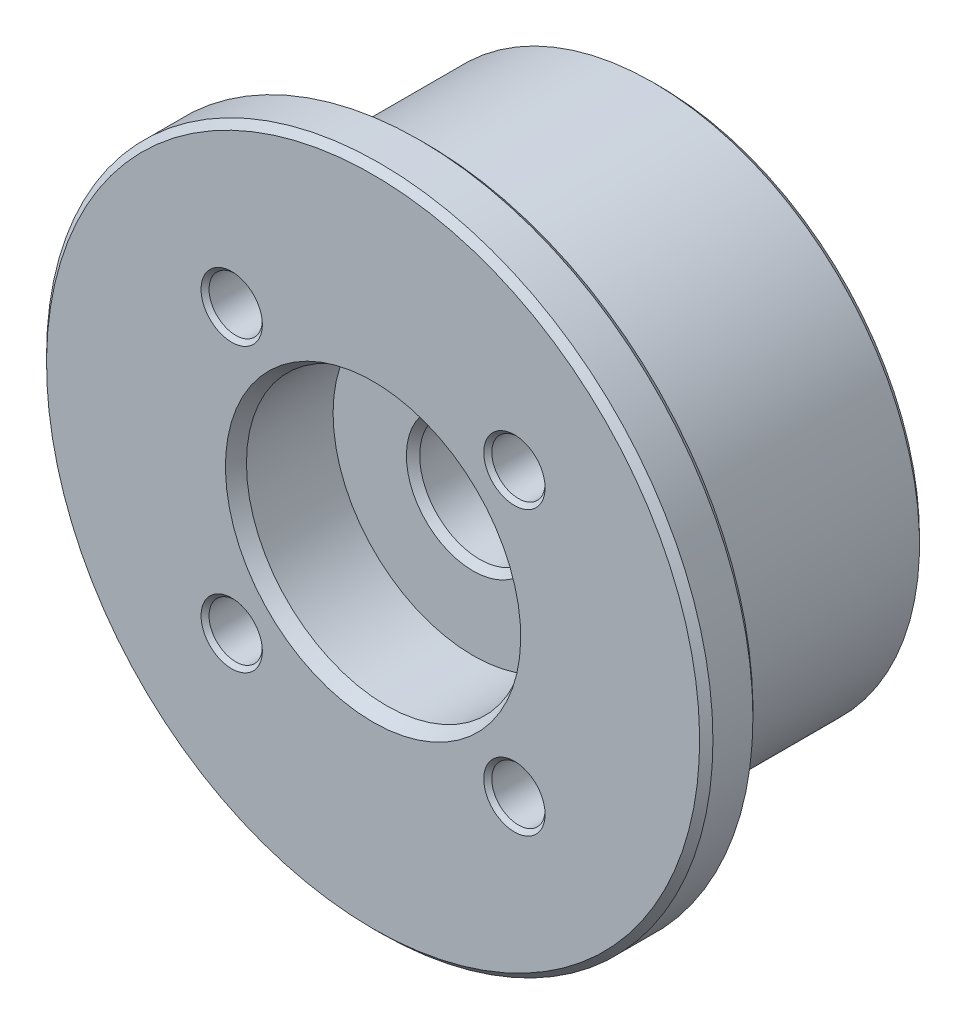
ISO-10303-21;
HEADER;
FILE_DESCRIPTION(('STEP AP214'),'2;1');
FILE_NAME('part.step','',(''),(''),'','','');
FILE_SCHEMA(('AUTOMOTIVE_DESIGN { 1 0 10303 214 1 1 1 1 }'));
ENDSEC;
DATA;
#1=APPLICATION_CONTEXT('core data for automotive mechanical design processes');
#2=APPLICATION_PROTOCOL_DEFINITION('international standard','automotive_design',2000,#1);
#3=PRODUCT_CONTEXT('',#1,'mechanical');
#4=PRODUCT('Part','Part','',(#3));
#5=PRODUCT_RELATED_PRODUCT_CATEGORY('part','',(#4));
#6=PRODUCT_DEFINITION_FORMATION('','',#4);
#7=PRODUCT_DEFINITION_CONTEXT('part definition',#1,'design');
#8=PRODUCT_DEFINITION('design','',#6,#7);
#9=PRODUCT_DEFINITION_SHAPE('','',#8);
#10=(LENGTH_UNIT() NAMED_UNIT(*) SI_UNIT(.MILLI.,.METRE.));
#11=(NAMED_UNIT(*) PLANE_ANGLE_UNIT() SI_UNIT($,.RADIAN.));
#12=(NAMED_UNIT(*) SI_UNIT($,.STERADIAN.) SOLID_ANGLE_UNIT());
#13=UNCERTAINTY_MEASURE_WITH_UNIT(LENGTH_MEASURE(1.E-05),#10,'distance_accuracy_value','');
#14=(GEOMETRIC_REPRESENTATION_CONTEXT(3) GLOBAL_UNCERTAINTY_ASSIGNED_CONTEXT((#13)) GLOBAL_UNIT_ASSIGNED_CONTEXT((#10,
#11,#12)) REPRESENTATION_CONTEXT('',''));
#15=CARTESIAN_POINT('',(0.,0.,0.));
#16=DIRECTION('',(0.,0.,1.));
#17=DIRECTION('',(1.,0.,0.));
#18=AXIS2_PLACEMENT_3D('',#15,#16,#17);
#19=CARTESIAN_POINT('',(0.,0.,0.));
#20=DIRECTION('',(0.,0.,-1.));
#21=DIRECTION('',(0.,1.,0.));
#22=AXIS2_PLACEMENT_3D('',#19,#20,#21);
#23=CYLINDRICAL_SURFACE('',#22,40.);
#24=CARTESIAN_POINT('',(0.,0.,1.00000000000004));
#25=DIRECTION('',(0.,0.,1.));
#26=DIRECTION('',(0.,-1.,0.));
#27=AXIS2_PLACEMENT_3D('',#24,#25,#26);
#28=CIRCLE('',#27,40.);
#29=CARTESIAN_POINT('',(0.,-40.,1.00000000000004));
#30=VERTEX_POINT('',#29);
#31=EDGE_CURVE('E101',#30,#30,#28,.T.);
#32=ORIENTED_EDGE('',*,*,#31,.T.);
#33=EDGE_LOOP('',(#32));
#34=FACE_BOUND('',#33,.T.);
#35=CARTESIAN_POINT('',(0.,0.,32.));
#36=DIRECTION('',(0.,0.,-1.));
#37=DIRECTION('',(0.,1.,0.));
#38=AXIS2_PLACEMENT_3D('',#35,#36,#37);
#39=CIRCLE('',#38,40.);
#40=CARTESIAN_POINT('',(0.,40.,32.));
#41=VERTEX_POINT('',#40);
#42=EDGE_CURVE('E32',#41,#41,#39,.T.);
#43=ORIENTED_EDGE('',*,*,#42,.T.);
#44=EDGE_LOOP('',(#43));
#45=FACE_BOUND('',#44,.T.);
#46=ADVANCED_FACE('F12',(#34,#45),#23,.T.);
#47=CARTESIAN_POINT('',(50.,0.,35.));
#48=DIRECTION('',(0.,0.,1.));
#49=DIRECTION('',(0.,-1.,0.));
#50=AXIS2_PLACEMENT_3D('',#47,#48,#49);
#51=PLANE('',#50);
#52=CARTESIAN_POINT('',(0.,0.,35.));
#53=DIRECTION('',(0.,0.,1.));
#54=DIRECTION('',(0.,-1.,0.));
#55=AXIS2_PLACEMENT_3D('',#52,#53,#54);
#56=CIRCLE('',#55,49.);
#57=CARTESIAN_POINT('',(0.,-49.,35.));
#58=VERTEX_POINT('',#57);
#59=EDGE_CURVE('E104',#58,#58,#56,.F.);
#60=ORIENTED_EDGE('',*,*,#59,.T.);
#61=EDGE_LOOP('',(#60));
#62=FACE_BOUND('',#61,.T.);
#63=CARTESIAN_POINT('',(0.,0.,35.));
#64=DIRECTION('',(0.,0.,-1.));
#65=DIRECTION('',(0.,1.,0.));
#66=AXIS2_PLACEMENT_3D('',#63,#64,#65);
#67=CIRCLE('',#66,42.);
#68=CARTESIAN_POINT('',(0.,42.,35.));
#69=VERTEX_POINT('',#68);
#70=EDGE_CURVE('E68',#69,#69,#67,.T.);
#71=ORIENTED_EDGE('',*,*,#70,.F.);
#72=EDGE_LOOP('',(#71));
#73=FACE_BOUND('',#72,.T.);
#74=ADVANCED_FACE('F151',(#62,#73),#51,.F.);
#75=CARTESIAN_POINT('',(0.,0.,43.));
#76=DIRECTION('',(0.,0.,-1.));
#77=DIRECTION('',(0.,1.,0.));
#78=AXIS2_PLACEMENT_3D('',#75,#76,#77);
#79=CYLINDRICAL_SURFACE('',#78,50.);
#80=CARTESIAN_POINT('',(0.,0.,36.));
#81=DIRECTION('',(0.,0.,1.));
#82=DIRECTION('',(0.,-1.,0.));
#83=AXIS2_PLACEMENT_3D('',#80,#81,#82);
#84=CIRCLE('',#83,50.);
#85=CARTESIAN_POINT('',(0.,-50.,36.));
#86=VERTEX_POINT('',#85);
#87=EDGE_CURVE('E107',#86,#86,#84,.T.);
#88=ORIENTED_EDGE('',*,*,#87,.T.);
#89=EDGE_LOOP('',(#88));
#90=FACE_BOUND('',#89,.T.);
#91=CARTESIAN_POINT('',(0.,0.,42.));
#92=DIRECTION('',(0.,0.,1.));
#93=DIRECTION('',(0.,-1.,0.));
#94=AXIS2_PLACEMENT_3D('',#91,#92,#93);
#95=CIRCLE('',#94,50.);
#96=CARTESIAN_POINT('',(0.,-50.,42.));
#97=VERTEX_POINT('',#96);
#98=EDGE_CURVE('E86',#97,#97,#95,.F.);
#99=ORIENTED_EDGE('',*,*,#98,.T.);
#100=EDGE_LOOP('',(#99));
#101=FACE_BOUND('',#100,.T.);
#102=ADVANCED_FACE('F158',(#90,#101),#79,.T.);
#103=CARTESIAN_POINT('',(0.,0.,43.));
#104=DIRECTION('',(0.,0.,1.));
#105=DIRECTION('',(0.,-1.,0.));
#106=AXIS2_PLACEMENT_3D('',#103,#104,#105);
#107=PLANE('',#106);
#108=CARTESIAN_POINT('',(0.,0.,43.));
#109=DIRECTION('',(0.,0.,1.));
#110=DIRECTION('',(0.,-1.,0.));
#111=AXIS2_PLACEMENT_3D('',#108,#109,#110);
#112=CIRCLE('',#111,22.1547005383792);
#113=CARTESIAN_POINT('',(0.,-22.1547005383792,43.));
#114=VERTEX_POINT('',#113);
#115=EDGE_CURVE('E95',#114,#114,#112,.F.);
#116=ORIENTED_EDGE('',*,*,#115,.T.);
#117=EDGE_LOOP('',(#116));
#118=FACE_BOUND('',#117,.T.);
#119=CARTESIAN_POINT('',(0.,0.,43.));
#120=DIRECTION('',(0.,0.,1.));
#121=DIRECTION('',(0.,-1.,0.));
#122=AXIS2_PLACEMENT_3D('',#119,#120,#121);
#123=CIRCLE('',#122,49.);
#124=CARTESIAN_POINT('',(0.,-49.,43.));
#125=VERTEX_POINT('',#124);
#126=EDGE_CURVE('E89',#125,#125,#123,.T.);
#127=ORIENTED_EDGE('',*,*,#126,.T.);
#128=EDGE_LOOP('',(#127));
#129=FACE_BOUND('',#128,.T.);
#130=CARTESIAN_POINT('',(-21.2132034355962,21.2132034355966,43.));
#131=DIRECTION('',(0.,0.,1.));
#132=DIRECTION('',(0.,-1.,0.));
#133=AXIS2_PLACEMENT_3D('',#130,#131,#132);
#134=CIRCLE('',#133,4.6);
#135=CARTESIAN_POINT('',(-21.2132034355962,16.6132034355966,43.));
#136=VERTEX_POINT('',#135);
#137=EDGE_CURVE('E71',#136,#136,#134,.T.);
#138=ORIENTED_EDGE('',*,*,#137,.F.);
#139=EDGE_LOOP('',(#138));
#140=FACE_BOUND('',#139,.T.);
#141=CARTESIAN_POINT('',(-21.2132034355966,-21.2132034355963,43.));
#142=DIRECTION('',(0.,0.,1.));
#143=DIRECTION('',(0.,-1.,0.));
#144=AXIS2_PLACEMENT_3D('',#141,#142,#143);
#145=CIRCLE('',#144,4.6);
#146=CARTESIAN_POINT('',(-21.2132034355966,-25.8132034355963,43.));
#147=VERTEX_POINT('',#146);
#148=EDGE_CURVE('E74',#147,#147,#145,.T.);
#149=ORIENTED_EDGE('',*,*,#148,.F.);
#150=EDGE_LOOP('',(#149));
#151=FACE_BOUND('',#150,.T.);
#152=CARTESIAN_POINT('',(21.2132034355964,-21.2132034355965,43.));
#153=DIRECTION('',(0.,0.,1.));
#154=DIRECTION('',(0.,-1.,0.));
#155=AXIS2_PLACEMENT_3D('',#152,#153,#154);
#156=CIRCLE('',#155,4.6);
#157=CARTESIAN_POINT('',(21.2132034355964,-25.8132034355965,43.));
#158=VERTEX_POINT('',#157);
#159=EDGE_CURVE('E77',#158,#158,#156,.T.);
#160=ORIENTED_EDGE('',*,*,#159,.F.);
#161=EDGE_LOOP('',(#160));
#162=FACE_BOUND('',#161,.T.);
#163=CARTESIAN_POINT('',(21.2132034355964,21.2132034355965,43.));
#164=DIRECTION('',(0.,0.,1.));
#165=DIRECTION('',(0.,-1.,0.));
#166=AXIS2_PLACEMENT_3D('',#163,#164,#165);
#167=CIRCLE('',#166,4.6);
#168=CARTESIAN_POINT('',(21.2132034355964,16.6132034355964,43.));
#169=VERTEX_POINT('',#168);
#170=EDGE_CURVE('E80',#169,#169,#167,.T.);
#171=ORIENTED_EDGE('',*,*,#170,.F.);
#172=EDGE_LOOP('',(#171));
#173=FACE_BOUND('',#172,.T.);
#174=ADVANCED_FACE('F127',(#118,#129,#140,#151,#162,#173),#107,.T.);
#175=CARTESIAN_POINT('',(0.,0.,0.));
#176=DIRECTION('',(0.,0.,1.));
#177=DIRECTION('',(0.,-1.,0.));
#178=AXIS2_PLACEMENT_3D('',#175,#176,#177);
#179=PLANE('',#178);
#180=CARTESIAN_POINT('',(0.,0.,0.));
#181=DIRECTION('',(0.,0.,1.));
#182=DIRECTION('',(0.,-1.,0.));
#183=AXIS2_PLACEMENT_3D('',#180,#181,#182);
#184=CIRCLE('',#183,10.1547005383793);
#185=CARTESIAN_POINT('',(0.,-10.1547005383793,0.));
#186=VERTEX_POINT('',#185);
#187=EDGE_CURVE('E110',#186,#186,#184,.T.);
#188=ORIENTED_EDGE('',*,*,#187,.T.);
#189=EDGE_LOOP('',(#188));
#190=FACE_BOUND('',#189,.T.);
#191=CARTESIAN_POINT('',(0.,0.,0.));
#192=DIRECTION('',(0.,0.,1.));
#193=DIRECTION('',(0.,-1.,0.));
#194=AXIS2_PLACEMENT_3D('',#191,#192,#193);
#195=CIRCLE('',#194,39.);
#196=CARTESIAN_POINT('',(0.,-39.,0.));
#197=VERTEX_POINT('',#196);
#198=EDGE_CURVE('E98',#197,#197,#195,.F.);
#199=ORIENTED_EDGE('',*,*,#198,.T.);
#200=EDGE_LOOP('',(#199));
#201=FACE_BOUND('',#200,.T.);
#202=ADVANCED_FACE('F123',(#190,#201),#179,.F.);
#203=CARTESIAN_POINT('',(0.,0.,28.));
#204=DIRECTION('',(0.,0.,1.));
#205=DIRECTION('',(0.,-1.,0.));
#206=AXIS2_PLACEMENT_3D('',#203,#204,#205);
#207=CYLINDRICAL_SURFACE('',#206,21.);
#208=CARTESIAN_POINT('',(0.,0.,41.));
#209=DIRECTION('',(0.,0.,1.));
#210=DIRECTION('',(0.,-1.,0.));
#211=AXIS2_PLACEMENT_3D('',#208,#209,#210);
#212=CIRCLE('',#211,21.);
#213=CARTESIAN_POINT('',(0.,-21.,41.));
#214=VERTEX_POINT('',#213);
#215=EDGE_CURVE('E92',#214,#214,#212,.T.);
#216=ORIENTED_EDGE('',*,*,#215,.T.);
#217=EDGE_LOOP('',(#216));
#218=FACE_BOUND('',#217,.T.);
#219=CARTESIAN_POINT('',(0.,0.,28.));
#220=DIRECTION('',(0.,0.,1.));
#221=DIRECTION('',(0.,-1.,0.));
#222=AXIS2_PLACEMENT_3D('',#219,#220,#221);
#223=CIRCLE('',#222,21.);
#224=CARTESIAN_POINT('',(0.,-21.,28.));
#225=VERTEX_POINT('',#224);
#226=EDGE_CURVE('E83',#225,#225,#223,.T.);
#227=ORIENTED_EDGE('',*,*,#226,.F.);
#228=EDGE_LOOP('',(#227));
#229=FACE_BOUND('',#228,.T.);
#230=ADVANCED_FACE('F126',(#218,#229),#207,.F.);
#231=CARTESIAN_POINT('',(0.,0.,28.));
#232=DIRECTION('',(0.,0.,1.));
#233=DIRECTION('',(0.,-1.,0.));
#234=AXIS2_PLACEMENT_3D('',#231,#232,#233);
#235=PLANE('',#234);
#236=CARTESIAN_POINT('',(0.,0.,28.));
#237=DIRECTION('',(0.,0.,1.));
#238=DIRECTION('',(0.,-1.,0.));
#239=AXIS2_PLACEMENT_3D('',#236,#237,#238);
#240=CIRCLE('',#239,10.);
#241=CARTESIAN_POINT('',(0.,-10.,28.));
#242=VERTEX_POINT('',#241);
#243=EDGE_CURVE('E8',#242,#242,#240,.F.);
#244=ORIENTED_EDGE('',*,*,#243,.T.);
#245=EDGE_LOOP('',(#244));
#246=FACE_BOUND('',#245,.T.);
#247=ORIENTED_EDGE('',*,*,#226,.T.);
#248=EDGE_LOOP('',(#247));
#249=FACE_BOUND('',#248,.T.);
#250=ADVANCED_FACE('F181',(#246,#249),#235,.T.);
#251=CARTESIAN_POINT('',(0.,0.,43.));
#252=DIRECTION('',(0.,0.,1.));
#253=DIRECTION('',(0.,-1.,0.));
#254=AXIS2_PLACEMENT_3D('',#251,#252,#253);
#255=CYLINDRICAL_SURFACE('',#254,9.);
#256=CARTESIAN_POINT('',(0.,0.,27.));
#257=DIRECTION('',(0.,0.,1.));
#258=DIRECTION('',(0.,-1.,0.));
#259=AXIS2_PLACEMENT_3D('',#256,#257,#258);
#260=CIRCLE('',#259,9.);
#261=CARTESIAN_POINT('',(0.,-9.,27.));
#262=VERTEX_POINT('',#261);
#263=EDGE_CURVE('E20',#262,#262,#260,.T.);
#264=ORIENTED_EDGE('',*,*,#263,.T.);
#265=EDGE_LOOP('',(#264));
#266=FACE_BOUND('',#265,.T.);
#267=CARTESIAN_POINT('',(0.,0.,2.00000000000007));
#268=DIRECTION('',(0.,0.,1.));
#269=DIRECTION('',(0.,-1.,0.));
#270=AXIS2_PLACEMENT_3D('',#267,#268,#269);
#271=CIRCLE('',#270,9.);
#272=CARTESIAN_POINT('',(0.,-9.,2.00000000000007));
#273=VERTEX_POINT('',#272);
#274=EDGE_CURVE('E25',#273,#273,#271,.F.);
#275=ORIENTED_EDGE('',*,*,#274,.T.);
#276=EDGE_LOOP('',(#275));
#277=FACE_BOUND('',#276,.T.);
#278=ADVANCED_FACE('F115',(#266,#277),#255,.F.);
#279=CARTESIAN_POINT('',(21.2132034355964,21.2132034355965,43.));
#280=DIRECTION('',(0.,0.,1.));
#281=DIRECTION('',(0.,-1.,0.));
#282=AXIS2_PLACEMENT_3D('',#279,#280,#281);
#283=CONICAL_SURFACE('',#282,4.6,0.78539816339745);
#284=CARTESIAN_POINT('',(21.2132034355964,21.2132034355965,42.4));
#285=DIRECTION('',(0.,0.,1.));
#286=DIRECTION('',(0.,-1.,0.));
#287=AXIS2_PLACEMENT_3D('',#284,#285,#286);
#288=CIRCLE('',#287,4.);
#289=CARTESIAN_POINT('',(21.2132034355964,17.2132034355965,42.4));
#290=VERTEX_POINT('',#289);
#291=EDGE_CURVE('E37',#290,#290,#288,.F.);
#292=ORIENTED_EDGE('',*,*,#291,.T.);
#293=EDGE_LOOP('',(#292));
#294=FACE_BOUND('',#293,.T.);
#295=ORIENTED_EDGE('',*,*,#170,.T.);
#296=EDGE_LOOP('',(#295));
#297=FACE_BOUND('',#296,.T.);
#298=ADVANCED_FACE('F175',(#294,#297),#283,.F.);
#299=CARTESIAN_POINT('',(21.2132034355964,-21.2132034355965,43.));
#300=DIRECTION('',(0.,0.,1.));
#301=DIRECTION('',(0.,-1.,0.));
#302=AXIS2_PLACEMENT_3D('',#299,#300,#301);
#303=CONICAL_SURFACE('',#302,4.6,0.78539816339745);
#304=CARTESIAN_POINT('',(21.2132034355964,-21.2132034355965,42.4));
#305=DIRECTION('',(0.,0.,1.));
#306=DIRECTION('',(0.,-1.,0.));
#307=AXIS2_PLACEMENT_3D('',#304,#305,#306);
#308=CIRCLE('',#307,4.);
#309=CARTESIAN_POINT('',(21.2132034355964,-25.2132034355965,42.4));
#310=VERTEX_POINT('',#309);
#311=EDGE_CURVE('E16',#310,#310,#308,.F.);
#312=ORIENTED_EDGE('',*,*,#311,.T.);
#313=EDGE_LOOP('',(#312));
#314=FACE_BOUND('',#313,.T.);
#315=ORIENTED_EDGE('',*,*,#159,.T.);
#316=EDGE_LOOP('',(#315));
#317=FACE_BOUND('',#316,.T.);
#318=ADVANCED_FACE('F171',(#314,#317),#303,.F.);
#319=CARTESIAN_POINT('',(-21.2132034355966,-21.2132034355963,43.));
#320=DIRECTION('',(0.,0.,1.));
#321=DIRECTION('',(0.,-1.,0.));
#322=AXIS2_PLACEMENT_3D('',#319,#320,#321);
#323=CONICAL_SURFACE('',#322,4.6,0.78539816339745);
#324=CARTESIAN_POINT('',(-21.2132034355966,-21.2132034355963,42.4));
#325=DIRECTION('',(0.,0.,1.));
#326=DIRECTION('',(0.,-1.,0.));
#327=AXIS2_PLACEMENT_3D('',#324,#325,#326);
#328=CIRCLE('',#327,4.);
#329=CARTESIAN_POINT('',(-21.2132034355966,-25.2132034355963,42.4));
#330=VERTEX_POINT('',#329);
#331=EDGE_CURVE('E29',#330,#330,#328,.F.);
#332=ORIENTED_EDGE('',*,*,#331,.T.);
#333=EDGE_LOOP('',(#332));
#334=FACE_BOUND('',#333,.T.);
#335=ORIENTED_EDGE('',*,*,#148,.T.);
#336=EDGE_LOOP('',(#335));
#337=FACE_BOUND('',#336,.T.);
#338=ADVANCED_FACE('F167',(#334,#337),#323,.F.);
#339=CARTESIAN_POINT('',(-21.2132034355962,21.2132034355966,43.));
#340=DIRECTION('',(0.,0.,1.));
#341=DIRECTION('',(0.,-1.,0.));
#342=AXIS2_PLACEMENT_3D('',#339,#340,#341);
#343=CONICAL_SURFACE('',#342,4.6,0.78539816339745);
#344=CARTESIAN_POINT('',(-21.2132034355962,21.2132034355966,42.4));
#345=DIRECTION('',(0.,0.,1.));
#346=DIRECTION('',(0.,-1.,0.));
#347=AXIS2_PLACEMENT_3D('',#344,#345,#346);
#348=CIRCLE('',#347,4.);
#349=CARTESIAN_POINT('',(-21.2132034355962,17.2132034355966,42.4));
#350=VERTEX_POINT('',#349);
#351=EDGE_CURVE('E34',#350,#350,#348,.F.);
#352=ORIENTED_EDGE('',*,*,#351,.T.);
#353=EDGE_LOOP('',(#352));
#354=FACE_BOUND('',#353,.T.);
#355=ORIENTED_EDGE('',*,*,#137,.T.);
#356=EDGE_LOOP('',(#355));
#357=FACE_BOUND('',#356,.T.);
#358=ADVANCED_FACE('F164',(#354,#357),#343,.F.);
#359=CARTESIAN_POINT('',(0.,0.,43.));
#360=DIRECTION('',(0.,0.,-1.));
#361=DIRECTION('',(0.,1.,0.));
#362=AXIS2_PLACEMENT_3D('',#359,#360,#361);
#363=CONICAL_SURFACE('',#362,49.,0.785398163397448);
#364=ORIENTED_EDGE('',*,*,#98,.F.);
#365=EDGE_LOOP('',(#364));
#366=FACE_BOUND('',#365,.T.);
#367=ORIENTED_EDGE('',*,*,#126,.F.);
#368=EDGE_LOOP('',(#367));
#369=FACE_BOUND('',#368,.T.);
#370=ADVANCED_FACE('F146',(#366,#369),#363,.T.);
#371=CARTESIAN_POINT('',(0.,0.,41.));
#372=DIRECTION('',(0.,0.,1.));
#373=DIRECTION('',(0.,-1.,0.));
#374=AXIS2_PLACEMENT_3D('',#371,#372,#373);
#375=CONICAL_SURFACE('',#374,21.,0.523598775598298);
#376=ORIENTED_EDGE('',*,*,#115,.F.);
#377=EDGE_LOOP('',(#376));
#378=FACE_BOUND('',#377,.T.);
#379=ORIENTED_EDGE('',*,*,#215,.F.);
#380=EDGE_LOOP('',(#379));
#381=FACE_BOUND('',#380,.T.);
#382=ADVANCED_FACE('F134',(#378,#381),#375,.F.);
#383=CARTESIAN_POINT('',(0.,0.,0.));
#384=DIRECTION('',(0.,0.,1.));
#385=DIRECTION('',(0.,-1.,0.));
#386=AXIS2_PLACEMENT_3D('',#383,#384,#385);
#387=CONICAL_SURFACE('',#386,39.,0.785398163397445);
#388=ORIENTED_EDGE('',*,*,#31,.F.);
#389=EDGE_LOOP('',(#388));
#390=FACE_BOUND('',#389,.T.);
#391=ORIENTED_EDGE('',*,*,#198,.F.);
#392=EDGE_LOOP('',(#391));
#393=FACE_BOUND('',#392,.T.);
#394=ADVANCED_FACE('F131',(#390,#393),#387,.T.);
#395=CARTESIAN_POINT('',(0.,0.,35.));
#396=DIRECTION('',(0.,0.,1.));
#397=DIRECTION('',(0.,-1.,0.));
#398=AXIS2_PLACEMENT_3D('',#395,#396,#397);
#399=CONICAL_SURFACE('',#398,49.,0.785398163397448);
#400=ORIENTED_EDGE('',*,*,#87,.F.);
#401=EDGE_LOOP('',(#400));
#402=FACE_BOUND('',#401,.T.);
#403=ORIENTED_EDGE('',*,*,#59,.F.);
#404=EDGE_LOOP('',(#403));
#405=FACE_BOUND('',#404,.T.);
#406=ADVANCED_FACE('F133',(#402,#405),#399,.T.);
#407=CARTESIAN_POINT('',(0.,0.,35.5));
#408=DIRECTION('',(0.,0.,-1.));
#409=DIRECTION('',(0.,1.,0.));
#410=AXIS2_PLACEMENT_3D('',#407,#408,#409);
#411=CONICAL_SURFACE('',#410,41.5,0.785398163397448);
#412=ORIENTED_EDGE('',*,*,#70,.T.);
#413=EDGE_LOOP('',(#412));
#414=FACE_BOUND('',#413,.T.);
#415=CARTESIAN_POINT('',(0.,0.,35.5));
#416=DIRECTION('',(0.,0.,-1.));
#417=DIRECTION('',(0.,1.,0.));
#418=AXIS2_PLACEMENT_3D('',#415,#416,#417);
#419=CIRCLE('',#418,41.5);
#420=CARTESIAN_POINT('',(0.,41.5,35.5));
#421=VERTEX_POINT('',#420);
#422=EDGE_CURVE('E65',#421,#421,#419,.T.);
#423=ORIENTED_EDGE('',*,*,#422,.F.);
#424=EDGE_LOOP('',(#423));
#425=FACE_BOUND('',#424,.T.);
#426=ADVANCED_FACE('F143',(#414,#425),#411,.F.);
#427=CARTESIAN_POINT('',(-41.5,0.,35.5));
#428=DIRECTION('',(0.,0.,-1.));
#429=DIRECTION('',(0.,1.,0.));
#430=AXIS2_PLACEMENT_3D('',#427,#428,#429);
#431=PLANE('',#430);
#432=ORIENTED_EDGE('',*,*,#422,.T.);
#433=EDGE_LOOP('',(#432));
#434=FACE_BOUND('',#433,.T.);
#435=CARTESIAN_POINT('',(0.,0.,35.5));
#436=DIRECTION('',(0.,0.,-1.));
#437=DIRECTION('',(0.,1.,0.));
#438=AXIS2_PLACEMENT_3D('',#435,#436,#437);
#439=CIRCLE('',#438,39.9);
#440=CARTESIAN_POINT('',(0.,39.9,35.5));
#441=VERTEX_POINT('',#440);
#442=EDGE_CURVE('E62',#441,#441,#439,.T.);
#443=ORIENTED_EDGE('',*,*,#442,.F.);
#444=EDGE_LOOP('',(#443));
#445=FACE_BOUND('',#444,.T.);
#446=ADVANCED_FACE('F315',(#434,#445),#431,.T.);
#447=CARTESIAN_POINT('',(0.,0.,35.1));
#448=DIRECTION('',(0.,0.,-1.));
#449=DIRECTION('',(0.,1.,0.));
#450=AXIS2_PLACEMENT_3D('',#447,#448,#449);
#451=TOROIDAL_SURFACE('',#450,39.9,0.4);
#452=ORIENTED_EDGE('',*,*,#442,.T.);
#453=EDGE_LOOP('',(#452));
#454=FACE_BOUND('',#453,.T.);
#455=CARTESIAN_POINT('',(0.,0.,35.1));
#456=DIRECTION('',(0.,0.,-1.));
#457=DIRECTION('',(0.,1.,0.));
#458=AXIS2_PLACEMENT_3D('',#455,#456,#457);
#459=CIRCLE('',#458,39.5);
#460=CARTESIAN_POINT('',(0.,39.5,35.1));
#461=VERTEX_POINT('',#460);
#462=EDGE_CURVE('E59',#461,#461,#459,.T.);
#463=ORIENTED_EDGE('',*,*,#462,.F.);
#464=EDGE_LOOP('',(#463));
#465=FACE_BOUND('',#464,.T.);
#466=ADVANCED_FACE('F322',(#454,#465),#451,.F.);
#467=CARTESIAN_POINT('',(0.,0.,0.999999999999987));
#468=DIRECTION('',(0.,0.,-1.));
#469=DIRECTION('',(0.,1.,0.));
#470=AXIS2_PLACEMENT_3D('',#467,#468,#469);
#471=CYLINDRICAL_SURFACE('',#470,39.5);
#472=ORIENTED_EDGE('',*,*,#462,.T.);
#473=EDGE_LOOP('',(#472));
#474=FACE_BOUND('',#473,.T.);
#475=CARTESIAN_POINT('',(0.,0.,32.5));
#476=DIRECTION('',(0.,0.,-1.));
#477=DIRECTION('',(0.,1.,0.));
#478=AXIS2_PLACEMENT_3D('',#475,#476,#477);
#479=CIRCLE('',#478,39.5);
#480=CARTESIAN_POINT('',(0.,39.5,32.5));
#481=VERTEX_POINT('',#480);
#482=EDGE_CURVE('E56',#481,#481,#479,.T.);
#483=ORIENTED_EDGE('',*,*,#482,.F.);
#484=EDGE_LOOP('',(#483));
#485=FACE_BOUND('',#484,.T.);
#486=ADVANCED_FACE('F330',(#474,#485),#471,.T.);
#487=CARTESIAN_POINT('',(0.,0.,32.));
#488=DIRECTION('',(0.,0.,-1.));
#489=DIRECTION('',(0.,1.,0.));
#490=AXIS2_PLACEMENT_3D('',#487,#488,#489);
#491=CONICAL_SURFACE('',#490,40.,0.785398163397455);
#492=ORIENTED_EDGE('',*,*,#482,.T.);
#493=EDGE_LOOP('',(#492));
#494=FACE_BOUND('',#493,.T.);
#495=ORIENTED_EDGE('',*,*,#42,.F.);
#496=EDGE_LOOP('',(#495));
#497=FACE_BOUND('',#496,.T.);
#498=ADVANCED_FACE('F120',(#494,#497),#491,.T.);
#499=CARTESIAN_POINT('',(0.,0.,0.));
#500=DIRECTION('',(0.,0.,-1.));
#501=DIRECTION('',(0.,1.,0.));
#502=AXIS2_PLACEMENT_3D('',#499,#500,#501);
#503=CONICAL_SURFACE('',#502,10.1547005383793,0.523598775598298);
#504=ORIENTED_EDGE('',*,*,#274,.F.);
#505=EDGE_LOOP('',(#504));
#506=FACE_BOUND('',#505,.T.);
#507=ORIENTED_EDGE('',*,*,#187,.F.);
#508=EDGE_LOOP('',(#507));
#509=FACE_BOUND('',#508,.T.);
#510=ADVANCED_FACE('F117',(#506,#509),#503,.F.);
#511=CARTESIAN_POINT('',(0.,0.,27.));
#512=DIRECTION('',(0.,0.,1.));
#513=DIRECTION('',(0.,-1.,0.));
#514=AXIS2_PLACEMENT_3D('',#511,#512,#513);
#515=CONICAL_SURFACE('',#514,9.,0.785398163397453);
#516=ORIENTED_EDGE('',*,*,#243,.F.);
#517=EDGE_LOOP('',(#516));
#518=FACE_BOUND('',#517,.T.);
#519=ORIENTED_EDGE('',*,*,#263,.F.);
#520=EDGE_LOOP('',(#519));
#521=FACE_BOUND('',#520,.T.);
#522=ADVANCED_FACE('F14',(#518,#521),#515,.F.);
#523=CARTESIAN_POINT('',(-21.2132034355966,-21.2132034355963,27.));
#524=DIRECTION('',(0.,0.,1.));
#525=DIRECTION('',(0.,-1.,0.));
#526=AXIS2_PLACEMENT_3D('',#523,#524,#525);
#527=PLANE('',#526);
#528=CARTESIAN_POINT('',(-21.2132034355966,-21.2132034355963,27.));
#529=DIRECTION('',(0.,0.,1.));
#530=DIRECTION('',(0.,-1.,0.));
#531=AXIS2_PLACEMENT_3D('',#528,#529,#530);
#532=CIRCLE('',#531,4.);
#533=CARTESIAN_POINT('',(-21.2132034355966,-25.2132034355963,27.));
#534=VERTEX_POINT('',#533);
#535=EDGE_CURVE('E33',#534,#534,#532,.T.);
#536=ORIENTED_EDGE('',*,*,#535,.T.);
#537=EDGE_LOOP('',(#536));
#538=FACE_BOUND('',#537,.T.);
#539=ADVANCED_FACE('F353',(#538),#527,.T.);
#540=CARTESIAN_POINT('',(-21.2132034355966,-21.2132034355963,27.));
#541=DIRECTION('',(0.,0.,1.));
#542=DIRECTION('',(0.,-1.,0.));
#543=AXIS2_PLACEMENT_3D('',#540,#541,#542);
#544=CYLINDRICAL_SURFACE('',#543,4.);
#545=ORIENTED_EDGE('',*,*,#535,.F.);
#546=EDGE_LOOP('',(#545));
#547=FACE_BOUND('',#546,.T.);
#548=ORIENTED_EDGE('',*,*,#331,.F.);
#549=EDGE_LOOP('',(#548));
#550=FACE_BOUND('',#549,.T.);
#551=ADVANCED_FACE('F360',(#547,#550),#544,.F.);
#552=CARTESIAN_POINT('',(-21.2132034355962,21.2132034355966,27.));
#553=DIRECTION('',(0.,0.,1.));
#554=DIRECTION('',(0.,-1.,0.));
#555=AXIS2_PLACEMENT_3D('',#552,#553,#554);
#556=PLANE('',#555);
#557=CARTESIAN_POINT('',(-21.2132034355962,21.2132034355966,27.));
#558=DIRECTION('',(0.,0.,1.));
#559=DIRECTION('',(0.,-1.,0.));
#560=AXIS2_PLACEMENT_3D('',#557,#558,#559);
#561=CIRCLE('',#560,4.);
#562=CARTESIAN_POINT('',(-21.2132034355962,17.2132034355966,27.));
#563=VERTEX_POINT('',#562);
#564=EDGE_CURVE('E36',#563,#563,#561,.T.);
#565=ORIENTED_EDGE('',*,*,#564,.T.);
#566=EDGE_LOOP('',(#565));
#567=FACE_BOUND('',#566,.T.);
#568=ADVANCED_FACE('F368',(#567),#556,.T.);
#569=CARTESIAN_POINT('',(-21.2132034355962,21.2132034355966,27.));
#570=DIRECTION('',(0.,0.,1.));
#571=DIRECTION('',(0.,-1.,0.));
#572=AXIS2_PLACEMENT_3D('',#569,#570,#571);
#573=CYLINDRICAL_SURFACE('',#572,4.);
#574=ORIENTED_EDGE('',*,*,#564,.F.);
#575=EDGE_LOOP('',(#574));
#576=FACE_BOUND('',#575,.T.);
#577=ORIENTED_EDGE('',*,*,#351,.F.);
#578=EDGE_LOOP('',(#577));
#579=FACE_BOUND('',#578,.T.);
#580=ADVANCED_FACE('F376',(#576,#579),#573,.F.);
#581=CARTESIAN_POINT('',(21.2132034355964,21.2132034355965,27.));
#582=DIRECTION('',(0.,0.,1.));
#583=DIRECTION('',(0.,-1.,0.));
#584=AXIS2_PLACEMENT_3D('',#581,#582,#583);
#585=PLANE('',#584);
#586=CARTESIAN_POINT('',(21.2132034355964,21.2132034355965,27.));
#587=DIRECTION('',(0.,0.,1.));
#588=DIRECTION('',(0.,-1.,0.));
#589=AXIS2_PLACEMENT_3D('',#586,#587,#588);
#590=CIRCLE('',#589,4.);
#591=CARTESIAN_POINT('',(21.2132034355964,17.2132034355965,27.));
#592=VERTEX_POINT('',#591);
#593=EDGE_CURVE('E39',#592,#592,#590,.T.);
#594=ORIENTED_EDGE('',*,*,#593,.T.);
#595=EDGE_LOOP('',(#594));
#596=FACE_BOUND('',#595,.T.);
#597=ADVANCED_FACE('F384',(#596),#585,.T.);
#598=CARTESIAN_POINT('',(21.2132034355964,21.2132034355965,27.));
#599=DIRECTION('',(0.,0.,1.));
#600=DIRECTION('',(0.,-1.,0.));
#601=AXIS2_PLACEMENT_3D('',#598,#599,#600);
#602=CYLINDRICAL_SURFACE('',#601,4.);
#603=ORIENTED_EDGE('',*,*,#593,.F.);
#604=EDGE_LOOP('',(#603));
#605=FACE_BOUND('',#604,.T.);
#606=ORIENTED_EDGE('',*,*,#291,.F.);
#607=EDGE_LOOP('',(#606));
#608=FACE_BOUND('',#607,.T.);
#609=ADVANCED_FACE('F392',(#605,#608),#602,.F.);
#610=CARTESIAN_POINT('',(21.2132034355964,-21.2132034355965,27.));
#611=DIRECTION('',(0.,0.,1.));
#612=DIRECTION('',(0.,-1.,0.));
#613=AXIS2_PLACEMENT_3D('',#610,#611,#612);
#614=PLANE('',#613);
#615=CARTESIAN_POINT('',(21.2132034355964,-21.2132034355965,27.));
#616=DIRECTION('',(0.,0.,1.));
#617=DIRECTION('',(0.,-1.,0.));
#618=AXIS2_PLACEMENT_3D('',#615,#616,#617);
#619=CIRCLE('',#618,4.);
#620=CARTESIAN_POINT('',(21.2132034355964,-25.2132034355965,27.));
#621=VERTEX_POINT('',#620);
#622=EDGE_CURVE('E49',#621,#621,#619,.T.);
#623=ORIENTED_EDGE('',*,*,#622,.T.);
#624=EDGE_LOOP('',(#623));
#625=FACE_BOUND('',#624,.T.);
#626=ADVANCED_FACE('F399',(#625),#614,.T.);
#627=CARTESIAN_POINT('',(21.2132034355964,-21.2132034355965,27.));
#628=DIRECTION('',(0.,0.,1.));
#629=DIRECTION('',(0.,-1.,0.));
#630=AXIS2_PLACEMENT_3D('',#627,#628,#629);
#631=CYLINDRICAL_SURFACE('',#630,4.);
#632=ORIENTED_EDGE('',*,*,#622,.F.);
#633=EDGE_LOOP('',(#632));
#634=FACE_BOUND('',#633,.T.);
#635=ORIENTED_EDGE('',*,*,#311,.F.);
#636=EDGE_LOOP('',(#635));
#637=FACE_BOUND('',#636,.T.);
#638=ADVANCED_FACE('F407',(#634,#637),#631,.F.);
#639=CLOSED_SHELL('',(#46,#74,#102,#174,#202,#230,#250,#278,#298,#318,#338,#358,#370,#382,#394,
#406,#426,#446,#466,#486,#498,#510,#522,#539,#551,#568,#580,#597,#609,#626,#638));
#640=MANIFOLD_SOLID_BREP('B1',#639);
#641=ADVANCED_BREP_SHAPE_REPRESENTATION('',(#18,#640),#14);
#642=SHAPE_DEFINITION_REPRESENTATION(#9,#641);
ENDSEC;
END-ISO-10303-21;
